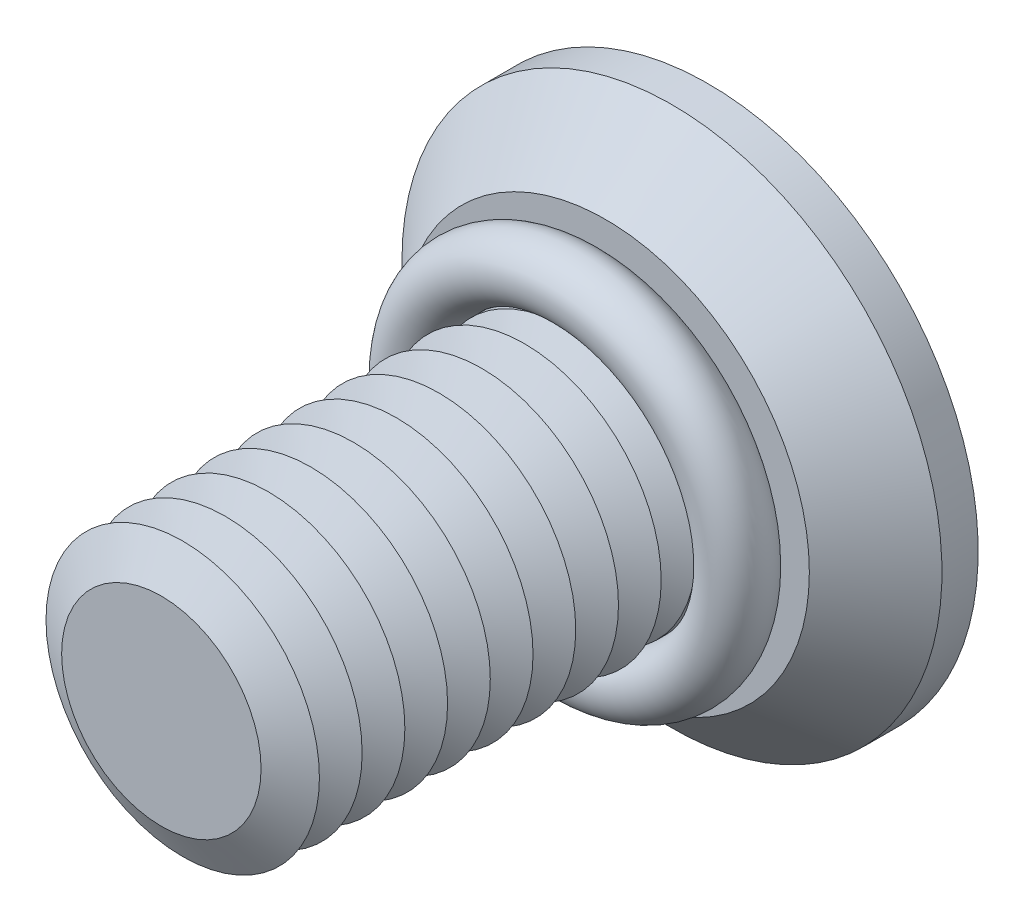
ISO-10303-21;
HEADER;
FILE_DESCRIPTION(('STEP AP214'),'2;1');
FILE_NAME('part.step','',(''),(''),'','','');
FILE_SCHEMA(('AUTOMOTIVE_DESIGN { 1 0 10303 214 1 1 1 1 }'));
ENDSEC;
DATA;
#1=APPLICATION_CONTEXT('core data for automotive mechanical design processes');
#2=APPLICATION_PROTOCOL_DEFINITION('international standard','automotive_design',2000,#1);
#3=PRODUCT_CONTEXT('',#1,'mechanical');
#4=PRODUCT('Part','Part','',(#3));
#5=PRODUCT_RELATED_PRODUCT_CATEGORY('part','',(#4));
#6=PRODUCT_DEFINITION_FORMATION('','',#4);
#7=PRODUCT_DEFINITION_CONTEXT('part definition',#1,'design');
#8=PRODUCT_DEFINITION('design','',#6,#7);
#9=PRODUCT_DEFINITION_SHAPE('','',#8);
#10=(LENGTH_UNIT() NAMED_UNIT(*) SI_UNIT(.MILLI.,.METRE.));
#11=(NAMED_UNIT(*) PLANE_ANGLE_UNIT() SI_UNIT($,.RADIAN.));
#12=(NAMED_UNIT(*) SI_UNIT($,.STERADIAN.) SOLID_ANGLE_UNIT());
#13=UNCERTAINTY_MEASURE_WITH_UNIT(LENGTH_MEASURE(1.E-05),#10,'distance_accuracy_value','');
#14=(GEOMETRIC_REPRESENTATION_CONTEXT(3) GLOBAL_UNCERTAINTY_ASSIGNED_CONTEXT((#13)) GLOBAL_UNIT_ASSIGNED_CONTEXT((#10,
#11,#12)) REPRESENTATION_CONTEXT('',''));
#15=CARTESIAN_POINT('',(0.,0.,0.));
#16=DIRECTION('',(0.,0.,1.));
#17=DIRECTION('',(1.,0.,0.));
#18=AXIS2_PLACEMENT_3D('',#15,#16,#17);
#19=CARTESIAN_POINT('',(0.,0.,3.9));
#20=DIRECTION('',(0.,0.,1.));
#21=DIRECTION('',(1.,0.,0.));
#22=AXIS2_PLACEMENT_3D('',#19,#20,#21);
#23=TOROIDAL_SURFACE('',#22,4.75,0.9);
#24=CARTESIAN_POINT('',(0.,4.75,3.9));
#25=DIRECTION('',(1.,0.,0.));
#26=DIRECTION('',(0.,0.,-1.));
#27=AXIS2_PLACEMENT_3D('',#24,#25,#26);
#28=CIRCLE('',#27,0.9);
#29=CARTESIAN_POINT('',(0.,5.65,3.9));
#30=VERTEX_POINT('',#29);
#31=EDGE_CURVE('P0_E10',#30,#30,#28,.T.);
#32=CARTESIAN_POINT('',(0.,0.,3.9));
#33=DIRECTION('',(0.,0.,1.));
#34=DIRECTION('',(1.,0.,0.));
#35=AXIS2_PLACEMENT_3D('',#32,#33,#34);
#36=CIRCLE('',#35,5.65);
#37=EDGE_CURVE('',#30,#30,#36,.T.);
#38=ORIENTED_EDGE('',*,*,#31,.F.);
#39=ORIENTED_EDGE('',*,*,#31,.T.);
#40=ORIENTED_EDGE('',*,*,#37,.T.);
#41=ORIENTED_EDGE('',*,*,#37,.F.);
#42=EDGE_LOOP('',(#38,#40,#39,#41));
#43=FACE_BOUND('',#42,.T.);
#44=ADVANCED_FACE('P0_F14',(#43),#23,.T.);
#45=CLOSED_SHELL('',(#44));
#46=MANIFOLD_SOLID_BREP('P0_B1',#45);
#47=CARTESIAN_POINT('',(0.,0.,9.75));
#48=DIRECTION('',(0.,0.,-1.));
#49=DIRECTION('',(-1.,0.,0.));
#50=AXIS2_PLACEMENT_3D('',#47,#48,#49);
#51=CONICAL_SURFACE('',#50,2.91746824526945,1.0471975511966);
#52=CARTESIAN_POINT('',(0.,0.,9.125));
#53=DIRECTION('',(0.,0.,1.));
#54=DIRECTION('',(1.,0.,0.));
#55=AXIS2_PLACEMENT_3D('',#52,#53,#54);
#56=CIRCLE('',#55,4.);
#57=CARTESIAN_POINT('',(4.,0.,9.125));
#58=VERTEX_POINT('',#57);
#59=EDGE_CURVE('P1_E324',#58,#58,#56,.T.);
#60=ORIENTED_EDGE('',*,*,#59,.T.);
#61=EDGE_LOOP('',(#60));
#62=FACE_BOUND('',#61,.T.);
#63=CARTESIAN_POINT('',(0.,0.,9.75));
#64=DIRECTION('',(0.,0.,1.));
#65=DIRECTION('',(1.,0.,0.));
#66=AXIS2_PLACEMENT_3D('',#63,#64,#65);
#67=CIRCLE('',#66,2.91746824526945);
#68=CARTESIAN_POINT('',(2.91746824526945,0.,9.75));
#69=VERTEX_POINT('',#68);
#70=EDGE_CURVE('P1_E321',#69,#69,#67,.T.);
#71=ORIENTED_EDGE('',*,*,#70,.F.);
#72=EDGE_LOOP('',(#71));
#73=FACE_BOUND('',#72,.T.);
#74=ADVANCED_FACE('P1_F15',(#62,#73),#51,.T.);
#75=CARTESIAN_POINT('',(0.,0.,10.375));
#76=DIRECTION('',(0.,0.,1.));
#77=DIRECTION('',(1.,0.,0.));
#78=AXIS2_PLACEMENT_3D('',#75,#76,#77);
#79=CONICAL_SURFACE('',#78,4.,1.0471975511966);
#80=ORIENTED_EDGE('',*,*,#70,.T.);
#81=EDGE_LOOP('',(#80));
#82=FACE_BOUND('',#81,.T.);
#83=CARTESIAN_POINT('',(0.,0.,10.375));
#84=DIRECTION('',(0.,0.,1.));
#85=DIRECTION('',(1.,0.,0.));
#86=AXIS2_PLACEMENT_3D('',#83,#84,#85);
#87=CIRCLE('',#86,4.);
#88=CARTESIAN_POINT('',(4.,0.,10.375));
#89=VERTEX_POINT('',#88);
#90=EDGE_CURVE('P1_E318',#89,#89,#87,.T.);
#91=ORIENTED_EDGE('',*,*,#90,.F.);
#92=EDGE_LOOP('',(#91));
#93=FACE_BOUND('',#92,.T.);
#94=ADVANCED_FACE('P1_F245',(#82,#93),#79,.T.);
#95=CARTESIAN_POINT('',(0.,0.,16.));
#96=DIRECTION('',(0.,0.,1.));
#97=DIRECTION('',(1.,0.,0.));
#98=AXIS2_PLACEMENT_3D('',#95,#96,#97);
#99=PLANE('',#98);
#100=CARTESIAN_POINT('',(0.,0.,16.));
#101=DIRECTION('',(0.,0.,1.));
#102=DIRECTION('',(1.,0.,0.));
#103=AXIS2_PLACEMENT_3D('',#100,#101,#102);
#104=CIRCLE('',#103,2.91746824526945);
#105=CARTESIAN_POINT('',(2.91746824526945,0.,16.));
#106=VERTEX_POINT('',#105);
#107=EDGE_CURVE('P1_E131',#106,#106,#104,.T.);
#108=ORIENTED_EDGE('',*,*,#107,.T.);
#109=EDGE_LOOP('',(#108));
#110=FACE_BOUND('',#109,.T.);
#111=ADVANCED_FACE('P1_F251',(#110),#99,.T.);
#112=CARTESIAN_POINT('',(0.,0.,16.));
#113=DIRECTION('',(0.,0.,-1.));
#114=DIRECTION('',(-1.,0.,0.));
#115=AXIS2_PLACEMENT_3D('',#112,#113,#114);
#116=CONICAL_SURFACE('',#115,2.91746824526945,1.0471975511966);
#117=CARTESIAN_POINT('',(0.,0.,15.375));
#118=DIRECTION('',(0.,0.,1.));
#119=DIRECTION('',(1.,0.,0.));
#120=AXIS2_PLACEMENT_3D('',#117,#118,#119);
#121=CIRCLE('',#120,4.);
#122=CARTESIAN_POINT('',(4.,0.,15.375));
#123=VERTEX_POINT('',#122);
#124=EDGE_CURVE('P1_E133',#123,#123,#121,.T.);
#125=ORIENTED_EDGE('',*,*,#124,.T.);
#126=EDGE_LOOP('',(#125));
#127=FACE_BOUND('',#126,.T.);
#128=ORIENTED_EDGE('',*,*,#107,.F.);
#129=EDGE_LOOP('',(#128));
#130=FACE_BOUND('',#129,.T.);
#131=ADVANCED_FACE('P1_F196',(#127,#130),#116,.T.);
#132=CARTESIAN_POINT('',(0.,0.,15.375));
#133=DIRECTION('',(0.,0.,1.));
#134=DIRECTION('',(1.,0.,0.));
#135=AXIS2_PLACEMENT_3D('',#132,#133,#134);
#136=CONICAL_SURFACE('',#135,4.,1.0471975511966);
#137=CARTESIAN_POINT('',(0.,0.,14.75));
#138=DIRECTION('',(0.,0.,1.));
#139=DIRECTION('',(1.,0.,0.));
#140=AXIS2_PLACEMENT_3D('',#137,#138,#139);
#141=CIRCLE('',#140,2.91746824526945);
#142=CARTESIAN_POINT('',(2.91746824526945,0.,14.75));
#143=VERTEX_POINT('',#142);
#144=EDGE_CURVE('P1_E297',#143,#143,#141,.T.);
#145=ORIENTED_EDGE('',*,*,#144,.T.);
#146=EDGE_LOOP('',(#145));
#147=FACE_BOUND('',#146,.T.);
#148=ORIENTED_EDGE('',*,*,#124,.F.);
#149=EDGE_LOOP('',(#148));
#150=FACE_BOUND('',#149,.T.);
#151=ADVANCED_FACE('P1_F284',(#147,#150),#136,.T.);
#152=CARTESIAN_POINT('',(0.,0.,14.75));
#153=DIRECTION('',(0.,0.,-1.));
#154=DIRECTION('',(-1.,0.,0.));
#155=AXIS2_PLACEMENT_3D('',#152,#153,#154);
#156=CONICAL_SURFACE('',#155,2.91746824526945,1.0471975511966);
#157=CARTESIAN_POINT('',(0.,0.,14.125));
#158=DIRECTION('',(0.,0.,1.));
#159=DIRECTION('',(1.,0.,0.));
#160=AXIS2_PLACEMENT_3D('',#157,#158,#159);
#161=CIRCLE('',#160,4.);
#162=CARTESIAN_POINT('',(4.,0.,14.125));
#163=VERTEX_POINT('',#162);
#164=EDGE_CURVE('P1_E294',#163,#163,#161,.T.);
#165=ORIENTED_EDGE('',*,*,#164,.T.);
#166=EDGE_LOOP('',(#165));
#167=FACE_BOUND('',#166,.T.);
#168=ORIENTED_EDGE('',*,*,#144,.F.);
#169=EDGE_LOOP('',(#168));
#170=FACE_BOUND('',#169,.T.);
#171=ADVANCED_FACE('P1_F279',(#167,#170),#156,.T.);
#172=CARTESIAN_POINT('',(0.,0.,14.125));
#173=DIRECTION('',(0.,0.,1.));
#174=DIRECTION('',(1.,0.,0.));
#175=AXIS2_PLACEMENT_3D('',#172,#173,#174);
#176=CONICAL_SURFACE('',#175,4.,1.0471975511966);
#177=CARTESIAN_POINT('',(0.,0.,13.5));
#178=DIRECTION('',(0.,0.,1.));
#179=DIRECTION('',(1.,0.,0.));
#180=AXIS2_PLACEMENT_3D('',#177,#178,#179);
#181=CIRCLE('',#180,2.91746824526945);
#182=CARTESIAN_POINT('',(2.91746824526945,0.,13.5));
#183=VERTEX_POINT('',#182);
#184=EDGE_CURVE('P1_E301',#183,#183,#181,.T.);
#185=ORIENTED_EDGE('',*,*,#184,.T.);
#186=EDGE_LOOP('',(#185));
#187=FACE_BOUND('',#186,.T.);
#188=ORIENTED_EDGE('',*,*,#164,.F.);
#189=EDGE_LOOP('',(#188));
#190=FACE_BOUND('',#189,.T.);
#191=ADVANCED_FACE('P1_F276',(#187,#190),#176,.T.);
#192=CARTESIAN_POINT('',(0.,0.,13.5));
#193=DIRECTION('',(0.,0.,-1.));
#194=DIRECTION('',(-1.,0.,0.));
#195=AXIS2_PLACEMENT_3D('',#192,#193,#194);
#196=CONICAL_SURFACE('',#195,2.91746824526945,1.0471975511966);
#197=CARTESIAN_POINT('',(0.,0.,12.875));
#198=DIRECTION('',(0.,0.,1.));
#199=DIRECTION('',(1.,0.,0.));
#200=AXIS2_PLACEMENT_3D('',#197,#198,#199);
#201=CIRCLE('',#200,4.);
#202=CARTESIAN_POINT('',(4.,0.,12.875));
#203=VERTEX_POINT('',#202);
#204=EDGE_CURVE('P1_E306',#203,#203,#201,.T.);
#205=ORIENTED_EDGE('',*,*,#204,.T.);
#206=EDGE_LOOP('',(#205));
#207=FACE_BOUND('',#206,.T.);
#208=ORIENTED_EDGE('',*,*,#184,.F.);
#209=EDGE_LOOP('',(#208));
#210=FACE_BOUND('',#209,.T.);
#211=ADVANCED_FACE('P1_F271',(#207,#210),#196,.T.);
#212=CARTESIAN_POINT('',(0.,0.,12.875));
#213=DIRECTION('',(0.,0.,1.));
#214=DIRECTION('',(1.,0.,0.));
#215=AXIS2_PLACEMENT_3D('',#212,#213,#214);
#216=CONICAL_SURFACE('',#215,4.,1.0471975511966);
#217=CARTESIAN_POINT('',(0.,0.,12.25));
#218=DIRECTION('',(0.,0.,1.));
#219=DIRECTION('',(1.,0.,0.));
#220=AXIS2_PLACEMENT_3D('',#217,#218,#219);
#221=CIRCLE('',#220,2.91746824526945);
#222=CARTESIAN_POINT('',(2.91746824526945,0.,12.25));
#223=VERTEX_POINT('',#222);
#224=EDGE_CURVE('P1_E309',#223,#223,#221,.T.);
#225=ORIENTED_EDGE('',*,*,#224,.T.);
#226=EDGE_LOOP('',(#225));
#227=FACE_BOUND('',#226,.T.);
#228=ORIENTED_EDGE('',*,*,#204,.F.);
#229=EDGE_LOOP('',(#228));
#230=FACE_BOUND('',#229,.T.);
#231=ADVANCED_FACE('P1_F268',(#227,#230),#216,.T.);
#232=CARTESIAN_POINT('',(0.,0.,12.25));
#233=DIRECTION('',(0.,0.,-1.));
#234=DIRECTION('',(-1.,0.,0.));
#235=AXIS2_PLACEMENT_3D('',#232,#233,#234);
#236=CONICAL_SURFACE('',#235,2.91746824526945,1.0471975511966);
#237=CARTESIAN_POINT('',(0.,0.,11.625));
#238=DIRECTION('',(0.,0.,1.));
#239=DIRECTION('',(1.,0.,0.));
#240=AXIS2_PLACEMENT_3D('',#237,#238,#239);
#241=CIRCLE('',#240,4.);
#242=CARTESIAN_POINT('',(4.,0.,11.625));
#243=VERTEX_POINT('',#242);
#244=EDGE_CURVE('P1_E312',#243,#243,#241,.T.);
#245=ORIENTED_EDGE('',*,*,#244,.T.);
#246=EDGE_LOOP('',(#245));
#247=FACE_BOUND('',#246,.T.);
#248=ORIENTED_EDGE('',*,*,#224,.F.);
#249=EDGE_LOOP('',(#248));
#250=FACE_BOUND('',#249,.T.);
#251=ADVANCED_FACE('P1_F262',(#247,#250),#236,.T.);
#252=CARTESIAN_POINT('',(0.,0.,11.625));
#253=DIRECTION('',(0.,0.,1.));
#254=DIRECTION('',(1.,0.,0.));
#255=AXIS2_PLACEMENT_3D('',#252,#253,#254);
#256=CONICAL_SURFACE('',#255,4.,1.0471975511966);
#257=CARTESIAN_POINT('',(0.,0.,11.));
#258=DIRECTION('',(0.,0.,1.));
#259=DIRECTION('',(1.,0.,0.));
#260=AXIS2_PLACEMENT_3D('',#257,#258,#259);
#261=CIRCLE('',#260,2.91746824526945);
#262=CARTESIAN_POINT('',(2.91746824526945,0.,11.));
#263=VERTEX_POINT('',#262);
#264=EDGE_CURVE('P1_E315',#263,#263,#261,.T.);
#265=ORIENTED_EDGE('',*,*,#264,.T.);
#266=EDGE_LOOP('',(#265));
#267=FACE_BOUND('',#266,.T.);
#268=ORIENTED_EDGE('',*,*,#244,.F.);
#269=EDGE_LOOP('',(#268));
#270=FACE_BOUND('',#269,.T.);
#271=ADVANCED_FACE('P1_F258',(#267,#270),#256,.T.);
#272=CARTESIAN_POINT('',(0.,0.,11.));
#273=DIRECTION('',(0.,0.,-1.));
#274=DIRECTION('',(-1.,0.,0.));
#275=AXIS2_PLACEMENT_3D('',#272,#273,#274);
#276=CONICAL_SURFACE('',#275,2.91746824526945,1.0471975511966);
#277=ORIENTED_EDGE('',*,*,#90,.T.);
#278=EDGE_LOOP('',(#277));
#279=FACE_BOUND('',#278,.T.);
#280=ORIENTED_EDGE('',*,*,#264,.F.);
#281=EDGE_LOOP('',(#280));
#282=FACE_BOUND('',#281,.T.);
#283=ADVANCED_FACE('P1_F261',(#279,#282),#276,.T.);
#284=CARTESIAN_POINT('',(0.,0.,8.5));
#285=DIRECTION('',(0.,0.,-1.));
#286=DIRECTION('',(-1.,0.,0.));
#287=AXIS2_PLACEMENT_3D('',#284,#285,#286);
#288=CONICAL_SURFACE('',#287,2.91746824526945,1.0471975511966);
#289=CARTESIAN_POINT('',(0.,0.,7.875));
#290=DIRECTION('',(0.,0.,1.));
#291=DIRECTION('',(1.,0.,0.));
#292=AXIS2_PLACEMENT_3D('',#289,#290,#291);
#293=CIRCLE('',#292,4.);
#294=CARTESIAN_POINT('',(4.,0.,7.875));
#295=VERTEX_POINT('',#294);
#296=EDGE_CURVE('P1_E329',#295,#295,#293,.T.);
#297=ORIENTED_EDGE('',*,*,#296,.T.);
#298=EDGE_LOOP('',(#297));
#299=FACE_BOUND('',#298,.T.);
#300=CARTESIAN_POINT('',(0.,0.,8.5));
#301=DIRECTION('',(0.,0.,1.));
#302=DIRECTION('',(1.,0.,0.));
#303=AXIS2_PLACEMENT_3D('',#300,#301,#302);
#304=CIRCLE('',#303,2.91746824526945);
#305=CARTESIAN_POINT('',(2.91746824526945,0.,8.5));
#306=VERTEX_POINT('',#305);
#307=EDGE_CURVE('P1_E326',#306,#306,#304,.T.);
#308=ORIENTED_EDGE('',*,*,#307,.F.);
#309=EDGE_LOOP('',(#308));
#310=FACE_BOUND('',#309,.T.);
#311=ADVANCED_FACE('P1_F266',(#299,#310),#288,.T.);
#312=CARTESIAN_POINT('',(0.,0.,9.125));
#313=DIRECTION('',(0.,0.,1.));
#314=DIRECTION('',(1.,0.,0.));
#315=AXIS2_PLACEMENT_3D('',#312,#313,#314);
#316=CONICAL_SURFACE('',#315,4.,1.0471975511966);
#317=ORIENTED_EDGE('',*,*,#307,.T.);
#318=EDGE_LOOP('',(#317));
#319=FACE_BOUND('',#318,.T.);
#320=ORIENTED_EDGE('',*,*,#59,.F.);
#321=EDGE_LOOP('',(#320));
#322=FACE_BOUND('',#321,.T.);
#323=ADVANCED_FACE('P1_F450',(#319,#322),#316,.T.);
#324=CARTESIAN_POINT('',(0.,0.,7.25));
#325=DIRECTION('',(0.,0.,-1.));
#326=DIRECTION('',(-1.,0.,0.));
#327=AXIS2_PLACEMENT_3D('',#324,#325,#326);
#328=CONICAL_SURFACE('',#327,2.91746824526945,1.0471975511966);
#329=CARTESIAN_POINT('',(0.,0.,6.625));
#330=DIRECTION('',(0.,0.,1.));
#331=DIRECTION('',(1.,0.,0.));
#332=AXIS2_PLACEMENT_3D('',#329,#330,#331);
#333=CIRCLE('',#332,4.);
#334=CARTESIAN_POINT('',(4.,0.,6.625));
#335=VERTEX_POINT('',#334);
#336=EDGE_CURVE('P1_E335',#335,#335,#333,.T.);
#337=ORIENTED_EDGE('',*,*,#336,.T.);
#338=EDGE_LOOP('',(#337));
#339=FACE_BOUND('',#338,.T.);
#340=CARTESIAN_POINT('',(0.,0.,7.25));
#341=DIRECTION('',(0.,0.,1.));
#342=DIRECTION('',(1.,0.,0.));
#343=AXIS2_PLACEMENT_3D('',#340,#341,#342);
#344=CIRCLE('',#343,2.91746824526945);
#345=CARTESIAN_POINT('',(2.91746824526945,0.,7.25));
#346=VERTEX_POINT('',#345);
#347=EDGE_CURVE('P1_E332',#346,#346,#344,.T.);
#348=ORIENTED_EDGE('',*,*,#347,.F.);
#349=EDGE_LOOP('',(#348));
#350=FACE_BOUND('',#349,.T.);
#351=ADVANCED_FACE('P1_F459',(#339,#350),#328,.T.);
#352=CARTESIAN_POINT('',(0.,0.,7.875));
#353=DIRECTION('',(0.,0.,1.));
#354=DIRECTION('',(1.,0.,0.));
#355=AXIS2_PLACEMENT_3D('',#352,#353,#354);
#356=CONICAL_SURFACE('',#355,4.,1.0471975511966);
#357=ORIENTED_EDGE('',*,*,#347,.T.);
#358=EDGE_LOOP('',(#357));
#359=FACE_BOUND('',#358,.T.);
#360=ORIENTED_EDGE('',*,*,#296,.F.);
#361=EDGE_LOOP('',(#360));
#362=FACE_BOUND('',#361,.T.);
#363=ADVANCED_FACE('P1_F469',(#359,#362),#356,.T.);
#364=CARTESIAN_POINT('',(0.,0.,6.));
#365=DIRECTION('',(0.,0.,-1.));
#366=DIRECTION('',(-1.,0.,0.));
#367=AXIS2_PLACEMENT_3D('',#364,#365,#366);
#368=CONICAL_SURFACE('',#367,2.91746824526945,1.0471975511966);
#369=CARTESIAN_POINT('',(0.,0.,5.375));
#370=DIRECTION('',(0.,0.,1.));
#371=DIRECTION('',(1.,0.,0.));
#372=AXIS2_PLACEMENT_3D('',#369,#370,#371);
#373=CIRCLE('',#372,4.);
#374=CARTESIAN_POINT('',(4.,0.,5.375));
#375=VERTEX_POINT('',#374);
#376=EDGE_CURVE('P1_E341',#375,#375,#373,.T.);
#377=ORIENTED_EDGE('',*,*,#376,.T.);
#378=EDGE_LOOP('',(#377));
#379=FACE_BOUND('',#378,.T.);
#380=CARTESIAN_POINT('',(0.,0.,6.));
#381=DIRECTION('',(0.,0.,1.));
#382=DIRECTION('',(1.,0.,0.));
#383=AXIS2_PLACEMENT_3D('',#380,#381,#382);
#384=CIRCLE('',#383,2.91746824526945);
#385=CARTESIAN_POINT('',(2.91746824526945,0.,6.));
#386=VERTEX_POINT('',#385);
#387=EDGE_CURVE('P1_E338',#386,#386,#384,.T.);
#388=ORIENTED_EDGE('',*,*,#387,.F.);
#389=EDGE_LOOP('',(#388));
#390=FACE_BOUND('',#389,.T.);
#391=ADVANCED_FACE('P1_F479',(#379,#390),#368,.T.);
#392=CARTESIAN_POINT('',(0.,0.,6.625));
#393=DIRECTION('',(0.,0.,1.));
#394=DIRECTION('',(1.,0.,0.));
#395=AXIS2_PLACEMENT_3D('',#392,#393,#394);
#396=CONICAL_SURFACE('',#395,4.,1.0471975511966);
#397=ORIENTED_EDGE('',*,*,#387,.T.);
#398=EDGE_LOOP('',(#397));
#399=FACE_BOUND('',#398,.T.);
#400=ORIENTED_EDGE('',*,*,#336,.F.);
#401=EDGE_LOOP('',(#400));
#402=FACE_BOUND('',#401,.T.);
#403=ADVANCED_FACE('P1_F354',(#399,#402),#396,.T.);
#404=CARTESIAN_POINT('',(0.,0.,4.75));
#405=DIRECTION('',(0.,0.,-1.));
#406=DIRECTION('',(-1.,0.,0.));
#407=AXIS2_PLACEMENT_3D('',#404,#405,#406);
#408=CONICAL_SURFACE('',#407,2.91746824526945,1.0471975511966);
#409=CARTESIAN_POINT('',(0.,0.,4.75));
#410=DIRECTION('',(0.,0.,1.));
#411=DIRECTION('',(1.,0.,0.));
#412=AXIS2_PLACEMENT_3D('',#409,#410,#411);
#413=CIRCLE('',#412,2.91746824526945);
#414=CARTESIAN_POINT('',(2.91746824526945,0.,4.75));
#415=VERTEX_POINT('',#414);
#416=EDGE_CURVE('P1_E344',#415,#415,#413,.T.);
#417=ORIENTED_EDGE('',*,*,#416,.F.);
#418=EDGE_LOOP('',(#417));
#419=FACE_BOUND('',#418,.T.);
#420=CARTESIAN_POINT('',(0.,0.,4.21160254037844));
#421=DIRECTION('',(0.,0.,-1.));
#422=DIRECTION('',(-1.,0.,0.));
#423=AXIS2_PLACEMENT_3D('',#420,#421,#422);
#424=CIRCLE('',#423,3.85);
#425=CARTESIAN_POINT('',(-3.85,0.,4.21160254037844));
#426=VERTEX_POINT('',#425);
#427=EDGE_CURVE('P1_E19',#426,#426,#424,.F.);
#428=ORIENTED_EDGE('',*,*,#427,.T.);
#429=EDGE_LOOP('',(#428));
#430=FACE_BOUND('',#429,.T.);
#431=ADVANCED_FACE('P1_F351',(#419,#430),#408,.T.);
#432=CARTESIAN_POINT('',(0.,0.,5.375));
#433=DIRECTION('',(0.,0.,1.));
#434=DIRECTION('',(1.,0.,0.));
#435=AXIS2_PLACEMENT_3D('',#432,#433,#434);
#436=CONICAL_SURFACE('',#435,4.,1.0471975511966);
#437=ORIENTED_EDGE('',*,*,#416,.T.);
#438=EDGE_LOOP('',(#437));
#439=FACE_BOUND('',#438,.T.);
#440=ORIENTED_EDGE('',*,*,#376,.F.);
#441=EDGE_LOOP('',(#440));
#442=FACE_BOUND('',#441,.T.);
#443=ADVANCED_FACE('P1_F348',(#439,#442),#436,.T.);
#444=CARTESIAN_POINT('',(0.,0.,3.));
#445=DIRECTION('',(0.,0.,-1.));
#446=DIRECTION('',(-1.,0.,0.));
#447=AXIS2_PLACEMENT_3D('',#444,#445,#446);
#448=CONICAL_SURFACE('',#447,2.5,1.0471975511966);
#449=CARTESIAN_POINT('',(0.,0.,4.44337567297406));
#450=VERTEX_POINT('',#449);
#451=VERTEX_LOOP('',#450);
#452=FACE_BOUND('',#451,.T.);
#453=CARTESIAN_POINT('',(0.,0.,3.));
#454=DIRECTION('',(0.,0.,-1.));
#455=DIRECTION('',(-1.,0.,0.));
#456=AXIS2_PLACEMENT_3D('',#453,#454,#455);
#457=CIRCLE('',#456,2.5);
#458=CARTESIAN_POINT('',(-2.5,0.,3.));
#459=VERTEX_POINT('',#458);
#460=CARTESIAN_POINT('',(-1.25,2.1650635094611,3.));
#461=VERTEX_POINT('',#460);
#462=EDGE_CURVE('P1_E117',#459,#461,#457,.T.);
#463=ORIENTED_EDGE('',*,*,#462,.T.);
#464=CARTESIAN_POINT('',(0.,0.,3.));
#465=DIRECTION('',(0.,0.,-1.));
#466=DIRECTION('',(-1.,0.,0.));
#467=AXIS2_PLACEMENT_3D('',#464,#465,#466);
#468=CIRCLE('',#467,2.5);
#469=CARTESIAN_POINT('',(1.25,2.1650635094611,3.));
#470=VERTEX_POINT('',#469);
#471=EDGE_CURVE('P1_E24',#461,#470,#468,.T.);
#472=ORIENTED_EDGE('',*,*,#471,.T.);
#473=CARTESIAN_POINT('',(2.5,0.,3.));
#474=VERTEX_POINT('',#473);
#475=EDGE_CURVE('P1_E713',#470,#474,#468,.T.);
#476=ORIENTED_EDGE('',*,*,#475,.T.);
#477=CARTESIAN_POINT('',(1.25,-2.1650635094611,3.));
#478=VERTEX_POINT('',#477);
#479=EDGE_CURVE('P1_E706',#474,#478,#468,.T.);
#480=ORIENTED_EDGE('',*,*,#479,.T.);
#481=CARTESIAN_POINT('',(-1.25,-2.1650635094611,3.));
#482=VERTEX_POINT('',#481);
#483=EDGE_CURVE('P1_E182',#478,#482,#468,.T.);
#484=ORIENTED_EDGE('',*,*,#483,.T.);
#485=EDGE_CURVE('P1_E179',#482,#459,#468,.T.);
#486=ORIENTED_EDGE('',*,*,#485,.T.);
#487=EDGE_LOOP('',(#463,#472,#476,#480,#484,#486));
#488=FACE_BOUND('',#487,.T.);
#489=ADVANCED_FACE('P1_F198',(#452,#488),#448,.F.);
#490=CARTESIAN_POINT('',(0.,0.,3.));
#491=DIRECTION('',(0.,0.,-1.));
#492=DIRECTION('',(-1.,0.,0.));
#493=AXIS2_PLACEMENT_3D('',#490,#491,#492);
#494=PLANE('',#493);
#495=ORIENTED_EDGE('',*,*,#483,.F.);
#496=DIRECTION('',(-0.866025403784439,-0.5,0.));
#497=VECTOR('',#496,1.);
#498=CARTESIAN_POINT('',(2.5,-1.44337567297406,3.));
#499=LINE('',#498,#497);
#500=CARTESIAN_POINT('',(0.,-2.88675134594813,3.));
#501=VERTEX_POINT('',#500);
#502=EDGE_CURVE('P1_E722',#478,#501,#499,.T.);
#503=ORIENTED_EDGE('',*,*,#502,.T.);
#504=DIRECTION('',(-0.866025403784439,0.5,0.));
#505=VECTOR('',#504,1.);
#506=CARTESIAN_POINT('',(0.,-2.88675134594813,3.));
#507=LINE('',#506,#505);
#508=EDGE_CURVE('P1_E729',#501,#482,#507,.T.);
#509=ORIENTED_EDGE('',*,*,#508,.T.);
#510=EDGE_LOOP('',(#495,#503,#509));
#511=FACE_BOUND('',#510,.T.);
#512=ADVANCED_FACE('P1_F521',(#511),#494,.T.);
#513=ORIENTED_EDGE('',*,*,#485,.F.);
#514=CARTESIAN_POINT('',(-2.5,-1.44337567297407,3.));
#515=VERTEX_POINT('',#514);
#516=EDGE_CURVE('P1_E732',#482,#515,#507,.T.);
#517=ORIENTED_EDGE('',*,*,#516,.T.);
#518=DIRECTION('',(0.,1.,0.));
#519=VECTOR('',#518,1.);
#520=CARTESIAN_POINT('',(-2.5,-1.44337567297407,3.));
#521=LINE('',#520,#519);
#522=EDGE_CURVE('P1_E123',#515,#459,#521,.T.);
#523=ORIENTED_EDGE('',*,*,#522,.T.);
#524=EDGE_LOOP('',(#513,#517,#523));
#525=FACE_BOUND('',#524,.T.);
#526=ADVANCED_FACE('P1_F231',(#525),#494,.T.);
#527=ORIENTED_EDGE('',*,*,#462,.F.);
#528=CARTESIAN_POINT('',(-2.5,1.44337567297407,3.));
#529=VERTEX_POINT('',#528);
#530=EDGE_CURVE('P1_E734',#459,#529,#521,.T.);
#531=ORIENTED_EDGE('',*,*,#530,.T.);
#532=DIRECTION('',(0.866025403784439,0.5,0.));
#533=VECTOR('',#532,1.);
#534=CARTESIAN_POINT('',(-2.5,1.44337567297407,3.));
#535=LINE('',#534,#533);
#536=EDGE_CURVE('P1_E737',#529,#461,#535,.T.);
#537=ORIENTED_EDGE('',*,*,#536,.T.);
#538=EDGE_LOOP('',(#527,#531,#537));
#539=FACE_BOUND('',#538,.T.);
#540=ADVANCED_FACE('P1_F538',(#539),#494,.T.);
#541=ORIENTED_EDGE('',*,*,#471,.F.);
#542=CARTESIAN_POINT('',(0.,2.88675134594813,3.));
#543=VERTEX_POINT('',#542);
#544=EDGE_CURVE('P1_E736',#461,#543,#535,.T.);
#545=ORIENTED_EDGE('',*,*,#544,.T.);
#546=DIRECTION('',(0.866025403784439,-0.5,0.));
#547=VECTOR('',#546,1.);
#548=CARTESIAN_POINT('',(0.,2.88675134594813,3.));
#549=LINE('',#548,#547);
#550=EDGE_CURVE('P1_E161',#543,#470,#549,.T.);
#551=ORIENTED_EDGE('',*,*,#550,.T.);
#552=EDGE_LOOP('',(#541,#545,#551));
#553=FACE_BOUND('',#552,.T.);
#554=ADVANCED_FACE('P1_F547',(#553),#494,.T.);
#555=ORIENTED_EDGE('',*,*,#475,.F.);
#556=CARTESIAN_POINT('',(2.5,1.44337567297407,3.));
#557=VERTEX_POINT('',#556);
#558=EDGE_CURVE('P1_E721',#470,#557,#549,.T.);
#559=ORIENTED_EDGE('',*,*,#558,.T.);
#560=DIRECTION('',(0.,-1.,0.));
#561=VECTOR('',#560,1.);
#562=CARTESIAN_POINT('',(2.5,1.44337567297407,3.));
#563=LINE('',#562,#561);
#564=EDGE_CURVE('P1_E716',#557,#474,#563,.T.);
#565=ORIENTED_EDGE('',*,*,#564,.T.);
#566=EDGE_LOOP('',(#555,#559,#565));
#567=FACE_BOUND('',#566,.T.);
#568=ADVANCED_FACE('P1_F556',(#567),#494,.T.);
#569=ORIENTED_EDGE('',*,*,#479,.F.);
#570=CARTESIAN_POINT('',(2.5,-1.44337567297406,3.));
#571=VERTEX_POINT('',#570);
#572=EDGE_CURVE('P1_E708',#474,#571,#563,.T.);
#573=ORIENTED_EDGE('',*,*,#572,.T.);
#574=EDGE_CURVE('P1_E125',#571,#478,#499,.T.);
#575=ORIENTED_EDGE('',*,*,#574,.T.);
#576=EDGE_LOOP('',(#569,#573,#575));
#577=FACE_BOUND('',#576,.T.);
#578=ADVANCED_FACE('P1_F229',(#577),#494,.T.);
#579=CARTESIAN_POINT('',(2.5,-1.44337567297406,3.));
#580=DIRECTION('',(0.5,-0.866025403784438,0.));
#581=DIRECTION('',(0.866025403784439,0.5,0.));
#582=AXIS2_PLACEMENT_3D('',#579,#580,#581);
#583=PLANE('',#582);
#584=DIRECTION('',(0.,0.,-1.));
#585=VECTOR('',#584,1.);
#586=CARTESIAN_POINT('',(2.5,-1.44337567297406,3.));
#587=LINE('',#586,#585);
#588=CARTESIAN_POINT('',(2.5,-1.44337567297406,0.));
#589=VERTEX_POINT('',#588);
#590=EDGE_CURVE('P1_E164',#571,#589,#587,.T.);
#591=ORIENTED_EDGE('',*,*,#590,.T.);
#592=CARTESIAN_POINT('',(2.5002,-1.44326020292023,-3.09419640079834E-05));
#593=CARTESIAN_POINT('',(2.3963647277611,-1.50320952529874,0.0160404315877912));
#594=CARTESIAN_POINT('',(2.29234116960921,-1.56326755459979,0.0306306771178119));
#595=CARTESIAN_POINT('',(2.08392662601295,-1.68359574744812,0.0562644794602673));
#596=CARTESIAN_POINT('',(1.97953550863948,-1.7438659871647,0.0673065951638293));
#597=CARTESIAN_POINT('',(1.77101887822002,-1.86425311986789,0.0851994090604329));
#598=CARTESIAN_POINT('',(1.66689477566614,-1.9243691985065,0.0920714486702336));
#599=CARTESIAN_POINT('',(1.45851376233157,-2.04467803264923,0.101286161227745));
#600=CARTESIAN_POINT('',(1.35425688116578,-2.10487077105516,0.10362971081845));
#601=CARTESIAN_POINT('',(1.14574311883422,-2.22525624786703,0.10362971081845));
#602=CARTESIAN_POINT('',(1.04148623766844,-2.28544898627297,0.101286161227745));
#603=CARTESIAN_POINT('',(0.833105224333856,-2.40575782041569,0.0920714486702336));
#604=CARTESIAN_POINT('',(0.728981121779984,-2.4658738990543,0.0851994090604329));
#605=CARTESIAN_POINT('',(0.520464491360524,-2.58626103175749,0.0673065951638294));
#606=CARTESIAN_POINT('',(0.416073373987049,-2.64653127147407,0.0562644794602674));
#607=CARTESIAN_POINT('',(0.207658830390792,-2.7668594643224,0.030630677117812));
#608=CARTESIAN_POINT('',(0.103635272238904,-2.82691749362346,0.0160404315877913));
#609=CARTESIAN_POINT('',(-0.000199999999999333,-2.88686681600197,-3.09419640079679E-05));
#610=B_SPLINE_CURVE_WITH_KNOTS('',3,(#592,#593,#594,#595,#596,#597,#598,#599,#600,#601,#602,
#603,#604,#605,#606,#607,#608,#609),.UNSPECIFIED.,.F.,.F.,(4,2,2,2,2,2,2,2,4),(0.,
0.362931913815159,0.726011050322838,1.08721601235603,1.44835104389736,1.80948607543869,
2.17069103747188,2.53377017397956,2.89670208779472),.UNSPECIFIED.);
#611=CARTESIAN_POINT('',(0.,-2.88675134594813,0.));
#612=VERTEX_POINT('',#611);
#613=EDGE_CURVE('P1_E118',#589,#612,#610,.T.);
#614=ORIENTED_EDGE('',*,*,#613,.T.);
#615=DIRECTION('',(0.,0.,-1.));
#616=VECTOR('',#615,1.);
#617=CARTESIAN_POINT('',(0.,-2.88675134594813,3.));
#618=LINE('',#617,#616);
#619=EDGE_CURVE('P1_E116',#501,#612,#618,.T.);
#620=ORIENTED_EDGE('',*,*,#619,.F.);
#621=ORIENTED_EDGE('',*,*,#502,.F.);
#622=ORIENTED_EDGE('',*,*,#574,.F.);
#623=EDGE_LOOP('',(#591,#614,#620,#621,#622));
#624=FACE_BOUND('',#623,.T.);
#625=ADVANCED_FACE('P1_F226',(#624),#583,.F.);
#626=CARTESIAN_POINT('',(0.,-2.88675134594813,3.));
#627=DIRECTION('',(-0.5,-0.866025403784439,0.));
#628=DIRECTION('',(0.866025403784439,-0.5,0.));
#629=AXIS2_PLACEMENT_3D('',#626,#627,#628);
#630=PLANE('',#629);
#631=ORIENTED_EDGE('',*,*,#619,.T.);
#632=CARTESIAN_POINT('',(0.000200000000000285,-2.88686681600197,-3.09419640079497E-05));
#633=CARTESIAN_POINT('',(-0.103635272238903,-2.82691749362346,0.0160404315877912));
#634=CARTESIAN_POINT('',(-0.207658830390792,-2.7668594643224,0.030630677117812));
#635=CARTESIAN_POINT('',(-0.416073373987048,-2.64653127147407,0.0562644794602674));
#636=CARTESIAN_POINT('',(-0.520464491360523,-2.58626103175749,0.0673065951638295));
#637=CARTESIAN_POINT('',(-0.728981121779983,-2.4658738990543,0.085199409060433));
#638=CARTESIAN_POINT('',(-0.833105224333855,-2.40575782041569,0.0920714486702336));
#639=CARTESIAN_POINT('',(-1.04148623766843,-2.28544898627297,0.101286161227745));
#640=CARTESIAN_POINT('',(-1.14574311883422,-2.22525624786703,0.10362971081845));
#641=CARTESIAN_POINT('',(-1.35425688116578,-2.10487077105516,0.10362971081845));
#642=CARTESIAN_POINT('',(-1.45851376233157,-2.04467803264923,0.101286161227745));
#643=CARTESIAN_POINT('',(-1.66689477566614,-1.9243691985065,0.0920714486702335));
#644=CARTESIAN_POINT('',(-1.77101887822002,-1.86425311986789,0.0851994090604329));
#645=CARTESIAN_POINT('',(-1.97953550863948,-1.74386598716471,0.0673065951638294));
#646=CARTESIAN_POINT('',(-2.08392662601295,-1.68359574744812,0.0562644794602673));
#647=CARTESIAN_POINT('',(-2.29234116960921,-1.56326755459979,0.0306306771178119));
#648=CARTESIAN_POINT('',(-2.3963647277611,-1.50320952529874,0.0160404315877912));
#649=CARTESIAN_POINT('',(-2.5002,-1.44326020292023,-3.09419640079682E-05));
#650=B_SPLINE_CURVE_WITH_KNOTS('',3,(#632,#633,#634,#635,#636,#637,#638,#639,#640,#641,#642,
#643,#644,#645,#646,#647,#648,#649),.UNSPECIFIED.,.F.,.F.,(4,2,2,2,2,2,2,2,4),(0.,
0.362931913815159,0.726011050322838,1.08721601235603,1.44835104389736,1.80948607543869,
2.17069103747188,2.53377017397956,2.89670208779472),.UNSPECIFIED.);
#651=CARTESIAN_POINT('',(-2.5,-1.44337567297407,0.));
#652=VERTEX_POINT('',#651);
#653=EDGE_CURVE('P1_E94',#612,#652,#650,.T.);
#654=ORIENTED_EDGE('',*,*,#653,.T.);
#655=DIRECTION('',(0.,0.,-1.));
#656=VECTOR('',#655,1.);
#657=CARTESIAN_POINT('',(-2.5,-1.44337567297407,3.));
#658=LINE('',#657,#656);
#659=EDGE_CURVE('P1_E112',#515,#652,#658,.T.);
#660=ORIENTED_EDGE('',*,*,#659,.F.);
#661=ORIENTED_EDGE('',*,*,#516,.F.);
#662=ORIENTED_EDGE('',*,*,#508,.F.);
#663=EDGE_LOOP('',(#631,#654,#660,#661,#662));
#664=FACE_BOUND('',#663,.T.);
#665=ADVANCED_FACE('P1_F110',(#664),#630,.F.);
#666=CARTESIAN_POINT('',(-2.5,-1.44337567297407,3.));
#667=DIRECTION('',(-1.,0.,0.));
#668=DIRECTION('',(0.,-1.,0.));
#669=AXIS2_PLACEMENT_3D('',#666,#667,#668);
#670=PLANE('',#669);
#671=ORIENTED_EDGE('',*,*,#659,.T.);
#672=CARTESIAN_POINT('',(-2.5,-3.76800948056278,-0.438146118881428));
#673=CARTESIAN_POINT('',(-2.5,-3.65512241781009,-0.412947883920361));
#674=CARTESIAN_POINT('',(-2.5,-3.54216337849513,-0.388066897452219));
#675=CARTESIAN_POINT('',(-2.5,-3.31606595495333,-0.339109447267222));
#676=CARTESIAN_POINT('',(-2.5,-3.202927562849,-0.315033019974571));
#677=CARTESIAN_POINT('',(-2.5,-2.97632910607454,-0.26783262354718));
#678=CARTESIAN_POINT('',(-2.5,-2.86286882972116,-0.244709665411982));
#679=CARTESIAN_POINT('',(-2.5,-2.63570880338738,-0.199678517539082));
#680=CARTESIAN_POINT('',(-2.5,-2.52200905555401,-0.177770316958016));
#681=CARTESIAN_POINT('',(-2.5,-2.18246936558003,-0.114640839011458));
#682=CARTESIAN_POINT('',(-2.5,-1.95621666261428,-0.0755946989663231));
#683=CARTESIAN_POINT('',(-2.5,-1.50233128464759,-0.00642421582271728));
#684=CARTESIAN_POINT('',(-2.5,-1.27469889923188,0.0237019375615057));
#685=CARTESIAN_POINT('',(-2.5,-0.930935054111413,0.0592624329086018));
#686=CARTESIAN_POINT('',(-2.5,-0.815306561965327,0.0695411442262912));
#687=CARTESIAN_POINT('',(-2.5,-0.58377590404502,0.0862573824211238));
#688=CARTESIAN_POINT('',(-2.5,-0.467873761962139,0.0926952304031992));
#689=CARTESIAN_POINT('',(-2.5,-0.235955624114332,0.101355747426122));
#690=CARTESIAN_POINT('',(-2.5,-0.119939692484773,0.103580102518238));
#691=CARTESIAN_POINT('',(-2.5,0.112094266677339,0.103677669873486));
#692=CARTESIAN_POINT('',(-2.5,0.228112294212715,0.101550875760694));
#693=CARTESIAN_POINT('',(-2.5,0.460464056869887,0.0930637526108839));
#694=CARTESIAN_POINT('',(-2.5,0.576797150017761,0.0866861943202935));
#695=CARTESIAN_POINT('',(-2.5,0.809186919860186,0.0700539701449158));
#696=CARTESIAN_POINT('',(-2.5,0.925243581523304,0.0597990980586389));
#697=CARTESIAN_POINT('',(-2.5,1.15707831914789,0.0359190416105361));
#698=CARTESIAN_POINT('',(-2.5,1.27285617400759,0.0222917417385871));
#699=CARTESIAN_POINT('',(-2.5,1.50403978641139,-0.0077859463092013));
#700=CARTESIAN_POINT('',(-2.5,1.61944554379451,-0.0242363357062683));
#701=CARTESIAN_POINT('',(-2.5,1.97116037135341,-0.0779484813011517));
#702=CARTESIAN_POINT('',(-2.5,2.20690405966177,-0.118894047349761));
#703=CARTESIAN_POINT('',(-2.5,2.67723558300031,-0.206964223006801));
#704=CARTESIAN_POINT('',(-2.5,2.9118232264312,-0.254089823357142));
#705=CARTESIAN_POINT('',(-2.5,3.38022088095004,-0.352353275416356));
#706=CARTESIAN_POINT('',(-2.5,3.61403064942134,-0.40349227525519));
#707=CARTESIAN_POINT('',(-2.5,4.08105387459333,-0.508428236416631));
#708=CARTESIAN_POINT('',(-2.5,4.31426731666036,-0.562225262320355));
#709=CARTESIAN_POINT('',(-2.5,4.77742011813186,-0.670976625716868));
#710=CARTESIAN_POINT('',(-2.5,5.00736469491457,-0.725908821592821));
#711=CARTESIAN_POINT('',(-2.5,5.46695141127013,-0.837043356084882));
#712=CARTESIAN_POINT('',(-2.5,5.69659354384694,-0.893245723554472));
#713=CARTESIAN_POINT('',(-2.5,6.15532898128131,-1.00649703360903));
#714=CARTESIAN_POINT('',(-2.5,6.38442260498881,-1.06354468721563));
#715=CARTESIAN_POINT('',(-2.5,6.84242442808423,-1.17834514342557));
#716=CARTESIAN_POINT('',(-2.5,7.07133263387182,-1.23609792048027));
#717=CARTESIAN_POINT('',(-2.5,7.30017784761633,-1.29409642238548));
#718=B_SPLINE_CURVE_WITH_KNOTS('',3,(#672,#673,#674,#675,#676,#677,#678,#679,#680,#681,#682,
#683,#684,#685,#686,#687,#688,#689,#690,#691,#692,#693,#694,#695,#696,#697,#698,#699,#700,#701,
#702,#703,#704,#705,#706,#707,#708,#709,#710,#711,#712,#713,#714,#715,#716,#717),.UNSPECIFIED.,
.F.,.F.,(4,2,2,2,2,2,2,2,2,2,2,2,2,2,2,2,2,2,2,2,2,2,4),(0.,0.346996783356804,0.694009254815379,
1.04138068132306,1.38874900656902,2.07743762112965,2.76598637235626,3.11418615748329,
3.46235682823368,3.81038814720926,4.15841997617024,4.50787110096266,4.85734081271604,
5.20703030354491,5.55671994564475,6.27438533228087,6.99216591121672,7.71015258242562,
8.42815670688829,9.13739674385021,9.84665290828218,10.5549206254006,11.2631627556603),.UNSPECIFIED.);
#719=CARTESIAN_POINT('',(-2.5,1.44337567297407,0.));
#720=VERTEX_POINT('',#719);
#721=EDGE_CURVE('P1_E10',#652,#720,#718,.T.);
#722=ORIENTED_EDGE('',*,*,#721,.T.);
#723=DIRECTION('',(0.,0.,-1.));
#724=VECTOR('',#723,1.);
#725=CARTESIAN_POINT('',(-2.5,1.44337567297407,3.));
#726=LINE('',#725,#724);
#727=EDGE_CURVE('P1_E124',#529,#720,#726,.T.);
#728=ORIENTED_EDGE('',*,*,#727,.F.);
#729=ORIENTED_EDGE('',*,*,#530,.F.);
#730=ORIENTED_EDGE('',*,*,#522,.F.);
#731=EDGE_LOOP('',(#671,#722,#728,#729,#730));
#732=FACE_BOUND('',#731,.T.);
#733=ADVANCED_FACE('P1_F120',(#732),#670,.F.);
#734=CARTESIAN_POINT('',(-2.5,1.44337567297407,3.));
#735=DIRECTION('',(-0.5,0.866025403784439,0.));
#736=DIRECTION('',(-0.866025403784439,-0.5,0.));
#737=AXIS2_PLACEMENT_3D('',#734,#735,#736);
#738=PLANE('',#737);
#739=ORIENTED_EDGE('',*,*,#727,.T.);
#740=CARTESIAN_POINT('',(-2.5002,1.44326020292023,-3.09419640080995E-05));
#741=CARTESIAN_POINT('',(-2.3963647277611,1.50320952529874,0.0160404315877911));
#742=CARTESIAN_POINT('',(-2.29234116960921,1.56326755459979,0.0306306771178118));
#743=CARTESIAN_POINT('',(-2.08392662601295,1.68359574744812,0.0562644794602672));
#744=CARTESIAN_POINT('',(-1.97953550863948,1.74386598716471,0.0673065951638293));
#745=CARTESIAN_POINT('',(-1.77101887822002,1.86425311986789,0.0851994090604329));
#746=CARTESIAN_POINT('',(-1.66689477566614,1.9243691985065,0.0920714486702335));
#747=CARTESIAN_POINT('',(-1.45851376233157,2.04467803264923,0.101286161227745));
#748=CARTESIAN_POINT('',(-1.35425688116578,2.10487077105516,0.10362971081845));
#749=CARTESIAN_POINT('',(-1.14574311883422,2.22525624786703,0.10362971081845));
#750=CARTESIAN_POINT('',(-1.04148623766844,2.28544898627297,0.101286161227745));
#751=CARTESIAN_POINT('',(-0.833105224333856,2.40575782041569,0.0920714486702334));
#752=CARTESIAN_POINT('',(-0.728981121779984,2.4658738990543,0.0851994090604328));
#753=CARTESIAN_POINT('',(-0.520464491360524,2.58626103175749,0.0673065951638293));
#754=CARTESIAN_POINT('',(-0.416073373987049,2.64653127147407,0.0562644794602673));
#755=CARTESIAN_POINT('',(-0.207658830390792,2.7668594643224,0.0306306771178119));
#756=CARTESIAN_POINT('',(-0.103635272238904,2.82691749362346,0.0160404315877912));
#757=CARTESIAN_POINT('',(0.000199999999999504,2.88686681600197,-3.09419640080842E-05));
#758=B_SPLINE_CURVE_WITH_KNOTS('',3,(#740,#741,#742,#743,#744,#745,#746,#747,#748,#749,#750,
#751,#752,#753,#754,#755,#756,#757),.UNSPECIFIED.,.F.,.F.,(4,2,2,2,2,2,2,2,4),(0.,
0.362931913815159,0.726011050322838,1.08721601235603,1.44835104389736,1.80948607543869,
2.17069103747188,2.53377017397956,2.89670208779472),.UNSPECIFIED.);
#759=CARTESIAN_POINT('',(0.,2.88675134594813,0.));
#760=VERTEX_POINT('',#759);
#761=EDGE_CURVE('P1_E136',#720,#760,#758,.T.);
#762=ORIENTED_EDGE('',*,*,#761,.T.);
#763=DIRECTION('',(0.,0.,-1.));
#764=VECTOR('',#763,1.);
#765=CARTESIAN_POINT('',(0.,2.88675134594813,3.));
#766=LINE('',#765,#764);
#767=EDGE_CURVE('P1_E155',#543,#760,#766,.T.);
#768=ORIENTED_EDGE('',*,*,#767,.F.);
#769=ORIENTED_EDGE('',*,*,#544,.F.);
#770=ORIENTED_EDGE('',*,*,#536,.F.);
#771=EDGE_LOOP('',(#739,#762,#768,#769,#770));
#772=FACE_BOUND('',#771,.T.);
#773=ADVANCED_FACE('P1_F153',(#772),#738,.F.);
#774=CARTESIAN_POINT('',(0.,2.88675134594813,3.));
#775=DIRECTION('',(0.5,0.866025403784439,0.));
#776=DIRECTION('',(-0.866025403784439,0.5,0.));
#777=AXIS2_PLACEMENT_3D('',#774,#775,#776);
#778=PLANE('',#777);
#779=ORIENTED_EDGE('',*,*,#767,.T.);
#780=CARTESIAN_POINT('',(-0.000200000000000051,2.88686681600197,-3.09419640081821E-05));
#781=CARTESIAN_POINT('',(0.103635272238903,2.82691749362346,0.0160404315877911));
#782=CARTESIAN_POINT('',(0.207658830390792,2.7668594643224,0.0306306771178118));
#783=CARTESIAN_POINT('',(0.416073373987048,2.64653127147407,0.0562644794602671));
#784=CARTESIAN_POINT('',(0.520464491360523,2.58626103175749,0.0673065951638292));
#785=CARTESIAN_POINT('',(0.728981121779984,2.4658738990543,0.0851994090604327));
#786=CARTESIAN_POINT('',(0.833105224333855,2.4057578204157,0.0920714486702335));
#787=CARTESIAN_POINT('',(1.04148623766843,2.28544898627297,0.101286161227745));
#788=CARTESIAN_POINT('',(1.14574311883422,2.22525624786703,0.10362971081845));
#789=CARTESIAN_POINT('',(1.35425688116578,2.10487077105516,0.10362971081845));
#790=CARTESIAN_POINT('',(1.45851376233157,2.04467803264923,0.101286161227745));
#791=CARTESIAN_POINT('',(1.66689477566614,1.9243691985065,0.0920714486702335));
#792=CARTESIAN_POINT('',(1.77101887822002,1.86425311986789,0.0851994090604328));
#793=CARTESIAN_POINT('',(1.97953550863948,1.74386598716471,0.0673065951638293));
#794=CARTESIAN_POINT('',(2.08392662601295,1.68359574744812,0.0562644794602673));
#795=CARTESIAN_POINT('',(2.29234116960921,1.56326755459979,0.0306306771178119));
#796=CARTESIAN_POINT('',(2.3963647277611,1.50320952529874,0.0160404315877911));
#797=CARTESIAN_POINT('',(2.5002,1.44326020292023,-3.09419640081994E-05));
#798=B_SPLINE_CURVE_WITH_KNOTS('',3,(#780,#781,#782,#783,#784,#785,#786,#787,#788,#789,#790,
#791,#792,#793,#794,#795,#796,#797),.UNSPECIFIED.,.F.,.F.,(4,2,2,2,2,2,2,2,4),(0.,
0.362931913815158,0.726011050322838,1.08721601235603,1.44835104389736,1.80948607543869,
2.17069103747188,2.53377017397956,2.89670208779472),.UNSPECIFIED.);
#799=CARTESIAN_POINT('',(2.5,1.44337567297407,0.));
#800=VERTEX_POINT('',#799);
#801=EDGE_CURVE('P1_E141',#760,#800,#798,.T.);
#802=ORIENTED_EDGE('',*,*,#801,.T.);
#803=DIRECTION('',(0.,0.,-1.));
#804=VECTOR('',#803,1.);
#805=CARTESIAN_POINT('',(2.5,1.44337567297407,3.));
#806=LINE('',#805,#804);
#807=EDGE_CURVE('P1_E162',#557,#800,#806,.T.);
#808=ORIENTED_EDGE('',*,*,#807,.F.);
#809=ORIENTED_EDGE('',*,*,#558,.F.);
#810=ORIENTED_EDGE('',*,*,#550,.F.);
#811=EDGE_LOOP('',(#779,#802,#808,#809,#810));
#812=FACE_BOUND('',#811,.T.);
#813=ADVANCED_FACE('P1_F158',(#812),#778,.F.);
#814=CARTESIAN_POINT('',(2.5,1.44337567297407,3.));
#815=DIRECTION('',(1.,0.,0.));
#816=DIRECTION('',(0.,0.,-1.));
#817=AXIS2_PLACEMENT_3D('',#814,#815,#816);
#818=PLANE('',#817);
#819=ORIENTED_EDGE('',*,*,#807,.T.);
#820=CARTESIAN_POINT('',(2.5,-3.76800948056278,-0.438146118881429));
#821=CARTESIAN_POINT('',(2.5,-3.65512241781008,-0.412947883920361));
#822=CARTESIAN_POINT('',(2.5,-3.54216337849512,-0.388066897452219));
#823=CARTESIAN_POINT('',(2.5,-3.31606595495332,-0.339109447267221));
#824=CARTESIAN_POINT('',(2.5,-3.202927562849,-0.315033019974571));
#825=CARTESIAN_POINT('',(2.5,-2.97632910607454,-0.26783262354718));
#826=CARTESIAN_POINT('',(2.5,-2.86286882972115,-0.244709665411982));
#827=CARTESIAN_POINT('',(2.5,-2.63570880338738,-0.199678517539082));
#828=CARTESIAN_POINT('',(2.5,-2.522009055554,-0.177770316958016));
#829=CARTESIAN_POINT('',(2.5,-2.18246936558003,-0.114640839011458));
#830=CARTESIAN_POINT('',(2.5,-1.95621666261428,-0.0755946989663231));
#831=CARTESIAN_POINT('',(2.5,-1.50233128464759,-0.00642421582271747));
#832=CARTESIAN_POINT('',(2.5,-1.27469889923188,0.0237019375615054));
#833=CARTESIAN_POINT('',(2.5,-0.930935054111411,0.0592624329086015));
#834=CARTESIAN_POINT('',(2.5,-0.815306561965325,0.069541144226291));
#835=CARTESIAN_POINT('',(2.5,-0.583775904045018,0.0862573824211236));
#836=CARTESIAN_POINT('',(2.5,-0.467873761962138,0.0926952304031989));
#837=CARTESIAN_POINT('',(2.5,-0.235955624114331,0.101355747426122));
#838=CARTESIAN_POINT('',(2.5,-0.119939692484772,0.103580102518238));
#839=CARTESIAN_POINT('',(2.5,0.11209426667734,0.103677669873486));
#840=CARTESIAN_POINT('',(2.5,0.228112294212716,0.101550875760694));
#841=CARTESIAN_POINT('',(2.5,0.460464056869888,0.0930637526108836));
#842=CARTESIAN_POINT('',(2.5,0.576797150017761,0.0866861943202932));
#843=CARTESIAN_POINT('',(2.5,0.809186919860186,0.0700539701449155));
#844=CARTESIAN_POINT('',(2.5,0.925243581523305,0.0597990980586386));
#845=CARTESIAN_POINT('',(2.5,1.1570783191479,0.0359190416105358));
#846=CARTESIAN_POINT('',(2.5,1.27285617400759,0.0222917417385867));
#847=CARTESIAN_POINT('',(2.5,1.5040397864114,-0.00778594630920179));
#848=CARTESIAN_POINT('',(2.5,1.61944554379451,-0.0242363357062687));
#849=CARTESIAN_POINT('',(2.5,1.97116037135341,-0.0779484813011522));
#850=CARTESIAN_POINT('',(2.5,2.20690405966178,-0.118894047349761));
#851=CARTESIAN_POINT('',(2.5,2.67723558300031,-0.206964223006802));
#852=CARTESIAN_POINT('',(2.5,2.9118232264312,-0.254089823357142));
#853=CARTESIAN_POINT('',(2.5,3.38022088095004,-0.352353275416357));
#854=CARTESIAN_POINT('',(2.5,3.61403064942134,-0.40349227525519));
#855=CARTESIAN_POINT('',(2.5,4.08105387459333,-0.508428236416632));
#856=CARTESIAN_POINT('',(2.5,4.31426731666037,-0.562225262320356));
#857=CARTESIAN_POINT('',(2.5,4.77742011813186,-0.670976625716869));
#858=CARTESIAN_POINT('',(2.5,5.00736469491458,-0.725908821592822));
#859=CARTESIAN_POINT('',(2.5,5.46695141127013,-0.837043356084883));
#860=CARTESIAN_POINT('',(2.5,5.69659354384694,-0.893245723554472));
#861=CARTESIAN_POINT('',(2.5,6.15532898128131,-1.00649703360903));
#862=CARTESIAN_POINT('',(2.5,6.38442260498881,-1.06354468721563));
#863=CARTESIAN_POINT('',(2.5,6.84242442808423,-1.17834514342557));
#864=CARTESIAN_POINT('',(2.5,7.07133263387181,-1.23609792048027));
#865=CARTESIAN_POINT('',(2.5,7.30017784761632,-1.29409642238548));
#866=B_SPLINE_CURVE_WITH_KNOTS('',3,(#820,#821,#822,#823,#824,#825,#826,#827,#828,#829,#830,
#831,#832,#833,#834,#835,#836,#837,#838,#839,#840,#841,#842,#843,#844,#845,#846,#847,#848,#849,
#850,#851,#852,#853,#854,#855,#856,#857,#858,#859,#860,#861,#862,#863,#864,#865),.UNSPECIFIED.,
.F.,.F.,(4,2,2,2,2,2,2,2,2,2,2,2,2,2,2,2,2,2,2,2,2,2,4),(0.,0.346996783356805,0.69400925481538,
1.04138068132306,1.38874900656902,2.07743762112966,2.76598637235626,3.11418615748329,
3.46235682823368,3.81038814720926,4.15841997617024,4.50787110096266,4.85734081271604,
5.20703030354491,5.55671994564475,6.27438533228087,6.99216591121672,7.71015258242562,
8.4281567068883,9.13739674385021,9.84665290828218,10.5549206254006,11.2631627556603),.UNSPECIFIED.);
#867=EDGE_CURVE('P1_E149',#800,#589,#866,.F.);
#868=ORIENTED_EDGE('',*,*,#867,.T.);
#869=ORIENTED_EDGE('',*,*,#590,.F.);
#870=ORIENTED_EDGE('',*,*,#572,.F.);
#871=ORIENTED_EDGE('',*,*,#564,.F.);
#872=EDGE_LOOP('',(#819,#868,#869,#870,#871));
#873=FACE_BOUND('',#872,.T.);
#874=ADVANCED_FACE('P1_F232',(#873),#818,.F.);
#875=CARTESIAN_POINT('',(0.,0.,0.));
#876=DIRECTION('',(0.,0.,-1.));
#877=DIRECTION('',(-1.,0.,0.));
#878=AXIS2_PLACEMENT_3D('',#875,#876,#877);
#879=CONICAL_SURFACE('',#878,2.88675134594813,1.30899693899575);
#880=CARTESIAN_POINT('',(0.,0.,0.));
#881=DIRECTION('',(0.,0.,-1.));
#882=DIRECTION('',(-1.,0.,0.));
#883=AXIS2_PLACEMENT_3D('',#880,#881,#882);
#884=CIRCLE('',#883,2.88675134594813);
#885=EDGE_CURVE('P1_E30',#589,#612,#884,.T.);
#886=ORIENTED_EDGE('',*,*,#885,.T.);
#887=ORIENTED_EDGE('',*,*,#613,.F.);
#888=EDGE_LOOP('',(#886,#887));
#889=FACE_BOUND('',#888,.T.);
#890=ADVANCED_FACE('P1_F195',(#889),#879,.F.);
#891=EDGE_CURVE('P1_E90',#612,#652,#884,.T.);
#892=ORIENTED_EDGE('',*,*,#891,.T.);
#893=ORIENTED_EDGE('',*,*,#653,.F.);
#894=EDGE_LOOP('',(#892,#893));
#895=FACE_BOUND('',#894,.T.);
#896=ADVANCED_FACE('P1_F92',(#895),#879,.F.);
#897=EDGE_CURVE('P1_E98',#652,#720,#884,.T.);
#898=ORIENTED_EDGE('',*,*,#897,.T.);
#899=ORIENTED_EDGE('',*,*,#721,.F.);
#900=EDGE_LOOP('',(#898,#899));
#901=FACE_BOUND('',#900,.T.);
#902=ADVANCED_FACE('P1_F102',(#901),#879,.F.);
#903=EDGE_CURVE('P1_E130',#720,#760,#884,.T.);
#904=ORIENTED_EDGE('',*,*,#903,.T.);
#905=ORIENTED_EDGE('',*,*,#761,.F.);
#906=EDGE_LOOP('',(#904,#905));
#907=FACE_BOUND('',#906,.T.);
#908=ADVANCED_FACE('P1_F630',(#907),#879,.F.);
#909=EDGE_CURVE('P1_E137',#760,#800,#884,.T.);
#910=ORIENTED_EDGE('',*,*,#909,.T.);
#911=ORIENTED_EDGE('',*,*,#801,.F.);
#912=EDGE_LOOP('',(#910,#911));
#913=FACE_BOUND('',#912,.T.);
#914=ADVANCED_FACE('P1_F144',(#913),#879,.F.);
#915=EDGE_CURVE('P1_E37',#800,#589,#884,.T.);
#916=ORIENTED_EDGE('',*,*,#915,.T.);
#917=ORIENTED_EDGE('',*,*,#867,.F.);
#918=EDGE_LOOP('',(#916,#917));
#919=FACE_BOUND('',#918,.T.);
#920=ADVANCED_FACE('P1_F616',(#919),#879,.F.);
#921=CARTESIAN_POINT('',(0.,0.,0.));
#922=DIRECTION('',(0.,0.,1.));
#923=DIRECTION('',(1.,0.,0.));
#924=AXIS2_PLACEMENT_3D('',#921,#922,#923);
#925=PLANE('',#924);
#926=ORIENTED_EDGE('',*,*,#915,.F.);
#927=ORIENTED_EDGE('',*,*,#909,.F.);
#928=ORIENTED_EDGE('',*,*,#903,.F.);
#929=ORIENTED_EDGE('',*,*,#897,.F.);
#930=ORIENTED_EDGE('',*,*,#891,.F.);
#931=ORIENTED_EDGE('',*,*,#885,.F.);
#932=EDGE_LOOP('',(#926,#927,#928,#929,#930,#931));
#933=FACE_BOUND('',#932,.T.);
#934=CARTESIAN_POINT('',(0.,0.,0.));
#935=DIRECTION('',(0.,0.,-1.));
#936=DIRECTION('',(-1.,0.,0.));
#937=AXIS2_PLACEMENT_3D('',#934,#935,#936);
#938=CIRCLE('',#937,7.9);
#939=CARTESIAN_POINT('',(-7.9,0.,0.));
#940=VERTEX_POINT('',#939);
#941=EDGE_CURVE('P1_E169',#940,#940,#938,.T.);
#942=ORIENTED_EDGE('',*,*,#941,.T.);
#943=EDGE_LOOP('',(#942));
#944=FACE_BOUND('',#943,.T.);
#945=ADVANCED_FACE('P1_F17',(#933,#944),#925,.F.);
#946=CARTESIAN_POINT('',(0.,0.,16.));
#947=DIRECTION('',(0.,0.,-1.));
#948=DIRECTION('',(-1.,0.,0.));
#949=AXIS2_PLACEMENT_3D('',#946,#947,#948);
#950=CYLINDRICAL_SURFACE('',#949,7.9);
#951=ORIENTED_EDGE('',*,*,#941,.F.);
#952=EDGE_LOOP('',(#951));
#953=FACE_BOUND('',#952,.T.);
#954=CARTESIAN_POINT('',(0.,0.,1.06));
#955=DIRECTION('',(0.,0.,-1.));
#956=DIRECTION('',(-1.,0.,0.));
#957=AXIS2_PLACEMENT_3D('',#954,#955,#956);
#958=CIRCLE('',#957,7.9);
#959=CARTESIAN_POINT('',(-7.9,0.,1.06));
#960=VERTEX_POINT('',#959);
#961=EDGE_CURVE('P1_E172',#960,#960,#958,.T.);
#962=ORIENTED_EDGE('',*,*,#961,.T.);
#963=EDGE_LOOP('',(#962));
#964=FACE_BOUND('',#963,.T.);
#965=ADVANCED_FACE('P1_F372',(#953,#964),#950,.T.);
#966=CARTESIAN_POINT('',(0.,0.,0.));
#967=DIRECTION('',(0.,0.,-1.));
#968=DIRECTION('',(-1.,0.,0.));
#969=AXIS2_PLACEMENT_3D('',#966,#967,#968);
#970=CONICAL_SURFACE('',#969,8.96,0.785398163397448);
#971=CARTESIAN_POINT('',(0.,0.,3.));
#972=DIRECTION('',(0.,0.,-1.));
#973=DIRECTION('',(-1.,0.,0.));
#974=AXIS2_PLACEMENT_3D('',#971,#972,#973);
#975=CIRCLE('',#974,5.96);
#976=CARTESIAN_POINT('',(-5.96,0.,3.));
#977=VERTEX_POINT('',#976);
#978=EDGE_CURVE('P1_E176',#977,#977,#975,.T.);
#979=ORIENTED_EDGE('',*,*,#978,.T.);
#980=EDGE_LOOP('',(#979));
#981=FACE_BOUND('',#980,.T.);
#982=ORIENTED_EDGE('',*,*,#961,.F.);
#983=EDGE_LOOP('',(#982));
#984=FACE_BOUND('',#983,.T.);
#985=ADVANCED_FACE('P1_F367',(#981,#984),#970,.T.);
#986=CARTESIAN_POINT('',(0.,3.85,3.));
#987=DIRECTION('',(0.,0.,-1.));
#988=DIRECTION('',(-1.,0.,0.));
#989=AXIS2_PLACEMENT_3D('',#986,#987,#988);
#990=PLANE('',#989);
#991=CARTESIAN_POINT('',(0.,0.,3.));
#992=DIRECTION('',(0.,0.,-1.));
#993=DIRECTION('',(-1.,0.,0.));
#994=AXIS2_PLACEMENT_3D('',#991,#992,#993);
#995=CIRCLE('',#994,3.85);
#996=CARTESIAN_POINT('',(-3.85,0.,3.));
#997=VERTEX_POINT('',#996);
#998=EDGE_CURVE('P1_E173',#997,#997,#995,.T.);
#999=ORIENTED_EDGE('',*,*,#998,.T.);
#1000=EDGE_LOOP('',(#999));
#1001=FACE_BOUND('',#1000,.T.);
#1002=ORIENTED_EDGE('',*,*,#978,.F.);
#1003=EDGE_LOOP('',(#1002));
#1004=FACE_BOUND('',#1003,.T.);
#1005=ADVANCED_FACE('P1_F361',(#1001,#1004),#990,.F.);
#1006=CARTESIAN_POINT('',(0.,0.,0.));
#1007=DIRECTION('',(0.,0.,-1.));
#1008=DIRECTION('',(-1.,0.,0.));
#1009=AXIS2_PLACEMENT_3D('',#1006,#1007,#1008);
#1010=CYLINDRICAL_SURFACE('',#1009,3.85);
#1011=ORIENTED_EDGE('',*,*,#998,.F.);
#1012=EDGE_LOOP('',(#1011));
#1013=FACE_BOUND('',#1012,.T.);
#1014=ORIENTED_EDGE('',*,*,#427,.F.);
#1015=EDGE_LOOP('',(#1014));
#1016=FACE_BOUND('',#1015,.T.);
#1017=ADVANCED_FACE('P1_F359',(#1013,#1016),#1010,.T.);
#1018=CLOSED_SHELL('',(#74,#94,#111,#131,#151,#171,#191,#211,#231,#251,#271,#283,#311,#323,#351,
#363,#391,#403,#431,#443,#489,#512,#526,#540,#554,#568,#578,#625,#665,#733,#773,#813,#874,#890,
#896,#902,#908,#914,#920,#945,#965,#985,#1005,#1017));
#1019=MANIFOLD_SOLID_BREP('P1_B1',#1018);
#1020=ADVANCED_BREP_SHAPE_REPRESENTATION('',(#18,#46,#1019),#14);
#1021=SHAPE_DEFINITION_REPRESENTATION(#9,#1020);
ENDSEC;
END-ISO-10303-21;
